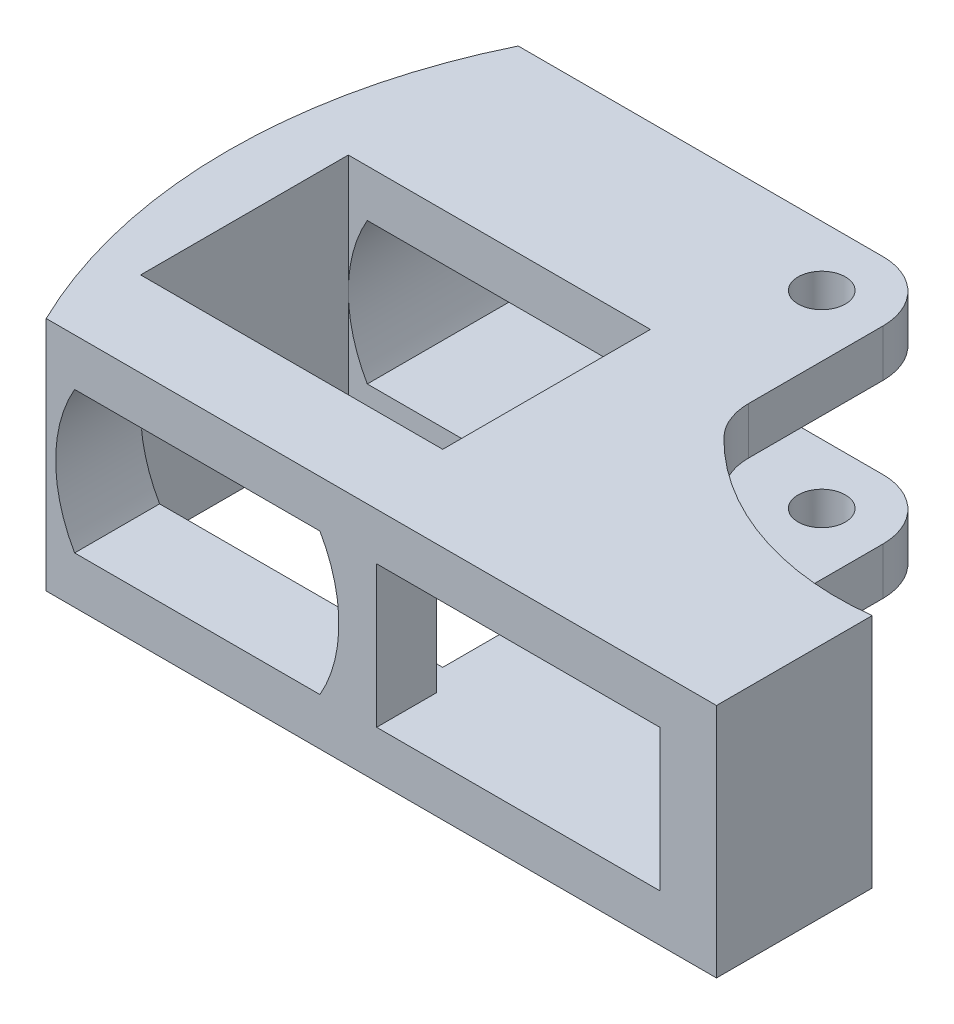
ISO-10303-21;
HEADER;
FILE_DESCRIPTION(('STEP AP214'),'2;1');
FILE_NAME('part.step','',(''),(''),'','','');
FILE_SCHEMA(('AUTOMOTIVE_DESIGN { 1 0 10303 214 1 1 1 1 }'));
ENDSEC;
DATA;
#1=APPLICATION_CONTEXT('core data for automotive mechanical design processes');
#2=APPLICATION_PROTOCOL_DEFINITION('international standard','automotive_design',2000,#1);
#3=PRODUCT_CONTEXT('',#1,'mechanical');
#4=PRODUCT('Part','Part','',(#3));
#5=PRODUCT_RELATED_PRODUCT_CATEGORY('part','',(#4));
#6=PRODUCT_DEFINITION_FORMATION('','',#4);
#7=PRODUCT_DEFINITION_CONTEXT('part definition',#1,'design');
#8=PRODUCT_DEFINITION('design','',#6,#7);
#9=PRODUCT_DEFINITION_SHAPE('','',#8);
#10=(LENGTH_UNIT() NAMED_UNIT(*) SI_UNIT(.MILLI.,.METRE.));
#11=(NAMED_UNIT(*) PLANE_ANGLE_UNIT() SI_UNIT($,.RADIAN.));
#12=(NAMED_UNIT(*) SI_UNIT($,.STERADIAN.) SOLID_ANGLE_UNIT());
#13=UNCERTAINTY_MEASURE_WITH_UNIT(LENGTH_MEASURE(1.E-05),#10,'distance_accuracy_value','');
#14=(GEOMETRIC_REPRESENTATION_CONTEXT(3) GLOBAL_UNCERTAINTY_ASSIGNED_CONTEXT((#13)) GLOBAL_UNIT_ASSIGNED_CONTEXT((#10,
#11,#12)) REPRESENTATION_CONTEXT('',''));
#15=CARTESIAN_POINT('',(0.,0.,0.));
#16=DIRECTION('',(0.,0.,1.));
#17=DIRECTION('',(1.,0.,0.));
#18=AXIS2_PLACEMENT_3D('',#15,#16,#17);
#19=CARTESIAN_POINT('',(-34.5,-12.5,-31.));
#20=DIRECTION('',(0.,0.,-1.));
#21=DIRECTION('',(-1.,0.,0.));
#22=AXIS2_PLACEMENT_3D('',#19,#20,#21);
#23=PLANE('',#22);
#24=DIRECTION('',(1.,0.,0.));
#25=VECTOR('',#24,1.);
#26=CARTESIAN_POINT('',(-34.5,7.5,-31.));
#27=LINE('',#26,#25);
#28=CARTESIAN_POINT('',(-32.4903810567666,7.5,-31.));
#29=VERTEX_POINT('',#28);
#30=CARTESIAN_POINT('',(-2.5,7.5,-31.));
#31=VERTEX_POINT('',#30);
#32=EDGE_CURVE('E257',#29,#31,#27,.T.);
#33=ORIENTED_EDGE('',*,*,#32,.T.);
#34=DIRECTION('',(0.,1.,0.));
#35=VECTOR('',#34,1.);
#36=CARTESIAN_POINT('',(-2.5,-12.5,-31.));
#37=LINE('',#36,#35);
#38=CARTESIAN_POINT('',(-2.5,12.5,-31.));
#39=VERTEX_POINT('',#38);
#40=EDGE_CURVE('E311',#31,#39,#37,.T.);
#41=ORIENTED_EDGE('',*,*,#40,.T.);
#42=DIRECTION('',(-1.,0.,0.));
#43=VECTOR('',#42,1.);
#44=CARTESIAN_POINT('',(-34.5,12.5,-31.));
#45=LINE('',#44,#43);
#46=CARTESIAN_POINT('',(-34.5,12.5,-31.));
#47=VERTEX_POINT('',#46);
#48=EDGE_CURVE('E283',#39,#47,#45,.T.);
#49=ORIENTED_EDGE('',*,*,#48,.T.);
#50=DIRECTION('',(0.,1.,0.));
#51=VECTOR('',#50,1.);
#52=CARTESIAN_POINT('',(-34.5,-12.5,-31.));
#53=LINE('',#52,#51);
#54=CARTESIAN_POINT('',(-34.5,0.,-31.));
#55=VERTEX_POINT('',#54);
#56=EDGE_CURVE('E307',#55,#47,#53,.T.);
#57=ORIENTED_EDGE('',*,*,#56,.F.);
#58=CARTESIAN_POINT('',(-19.5,0.,-31.));
#59=DIRECTION('',(0.,0.,-1.));
#60=DIRECTION('',(-1.,0.,0.));
#61=AXIS2_PLACEMENT_3D('',#58,#59,#60);
#62=CIRCLE('',#61,15.);
#63=EDGE_CURVE('E275',#55,#29,#62,.T.);
#64=ORIENTED_EDGE('',*,*,#63,.T.);
#65=EDGE_LOOP('',(#33,#41,#49,#57,#64));
#66=FACE_BOUND('',#65,.T.);
#67=ADVANCED_FACE('F46',(#66),#23,.F.);
#68=CARTESIAN_POINT('',(-2.5,-12.5,-31.));
#69=DIRECTION('',(1.,0.,0.));
#70=DIRECTION('',(0.,0.,-1.));
#71=AXIS2_PLACEMENT_3D('',#68,#69,#70);
#72=PLANE('',#71);
#73=ORIENTED_EDGE('',*,*,#40,.F.);
#74=DIRECTION('',(0.,0.,1.));
#75=VECTOR('',#74,1.);
#76=CARTESIAN_POINT('',(-2.5,7.5,-31.));
#77=LINE('',#76,#75);
#78=CARTESIAN_POINT('',(-2.5,7.5,-9.00000000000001));
#79=VERTEX_POINT('',#78);
#80=EDGE_CURVE('E484',#31,#79,#77,.T.);
#81=ORIENTED_EDGE('',*,*,#80,.T.);
#82=DIRECTION('',(0.,1.,0.));
#83=VECTOR('',#82,1.);
#84=CARTESIAN_POINT('',(-2.5,-12.5,-9.00000000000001));
#85=LINE('',#84,#83);
#86=CARTESIAN_POINT('',(-2.5,12.5,-9.00000000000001));
#87=VERTEX_POINT('',#86);
#88=EDGE_CURVE('E315',#79,#87,#85,.T.);
#89=ORIENTED_EDGE('',*,*,#88,.T.);
#90=DIRECTION('',(0.,0.,-1.));
#91=VECTOR('',#90,1.);
#92=CARTESIAN_POINT('',(-2.5,12.5,-31.));
#93=LINE('',#92,#91);
#94=EDGE_CURVE('E298',#87,#39,#93,.T.);
#95=ORIENTED_EDGE('',*,*,#94,.T.);
#96=EDGE_LOOP('',(#73,#81,#89,#95));
#97=FACE_BOUND('',#96,.T.);
#98=ADVANCED_FACE('F544',(#97),#72,.F.);
#99=CARTESIAN_POINT('',(-34.5,-12.5,-9.00000000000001));
#100=DIRECTION('',(0.,0.,1.));
#101=DIRECTION('',(1.,0.,0.));
#102=AXIS2_PLACEMENT_3D('',#99,#100,#101);
#103=PLANE('',#102);
#104=ORIENTED_EDGE('',*,*,#88,.F.);
#105=DIRECTION('',(-1.,0.,0.));
#106=VECTOR('',#105,1.);
#107=CARTESIAN_POINT('',(-34.5,7.5,-9.00000000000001));
#108=LINE('',#107,#106);
#109=CARTESIAN_POINT('',(-32.4903810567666,7.5,-9.00000000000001));
#110=VERTEX_POINT('',#109);
#111=EDGE_CURVE('E385',#79,#110,#108,.T.);
#112=ORIENTED_EDGE('',*,*,#111,.T.);
#113=CARTESIAN_POINT('',(-19.5,0.,-9.00000000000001));
#114=DIRECTION('',(0.,0.,1.));
#115=DIRECTION('',(1.,0.,0.));
#116=AXIS2_PLACEMENT_3D('',#113,#114,#115);
#117=CIRCLE('',#116,15.);
#118=CARTESIAN_POINT('',(-34.5,0.,-9.00000000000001));
#119=VERTEX_POINT('',#118);
#120=EDGE_CURVE('E387',#110,#119,#117,.T.);
#121=ORIENTED_EDGE('',*,*,#120,.T.);
#122=DIRECTION('',(0.,1.,0.));
#123=VECTOR('',#122,1.);
#124=CARTESIAN_POINT('',(-34.5,-12.5,-9.00000000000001));
#125=LINE('',#124,#123);
#126=CARTESIAN_POINT('',(-34.5,12.5,-9.00000000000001));
#127=VERTEX_POINT('',#126);
#128=EDGE_CURVE('E292',#119,#127,#125,.T.);
#129=ORIENTED_EDGE('',*,*,#128,.T.);
#130=DIRECTION('',(1.,0.,0.));
#131=VECTOR('',#130,1.);
#132=CARTESIAN_POINT('',(-34.5,12.5,-9.00000000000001));
#133=LINE('',#132,#131);
#134=EDGE_CURVE('E295',#127,#87,#133,.T.);
#135=ORIENTED_EDGE('',*,*,#134,.T.);
#136=EDGE_LOOP('',(#104,#112,#121,#129,#135));
#137=FACE_BOUND('',#136,.T.);
#138=ADVANCED_FACE('F542',(#137),#103,.F.);
#139=CARTESIAN_POINT('',(9.5,12.5,-50.));
#140=DIRECTION('',(1.,0.,0.));
#141=DIRECTION('',(0.,0.,-1.));
#142=AXIS2_PLACEMENT_3D('',#139,#140,#141);
#143=PLANE('',#142);
#144=DIRECTION('',(0.,0.,1.));
#145=VECTOR('',#144,1.);
#146=CARTESIAN_POINT('',(9.5,7.5,-50.));
#147=LINE('',#146,#145);
#148=CARTESIAN_POINT('',(9.5,7.5,-43.65));
#149=VERTEX_POINT('',#148);
#150=CARTESIAN_POINT('',(9.5,7.5,-29.414084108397));
#151=VERTEX_POINT('',#150);
#152=EDGE_CURVE('E407',#149,#151,#147,.T.);
#153=ORIENTED_EDGE('',*,*,#152,.F.);
#154=DIRECTION('',(0.,-1.,0.));
#155=VECTOR('',#154,1.);
#156=CARTESIAN_POINT('',(9.5,12.5,-43.65));
#157=LINE('',#156,#155);
#158=CARTESIAN_POINT('',(9.5,12.5,-43.65));
#159=VERTEX_POINT('',#158);
#160=EDGE_CURVE('E371',#149,#159,#157,.F.);
#161=ORIENTED_EDGE('',*,*,#160,.T.);
#162=DIRECTION('',(0.,0.,1.));
#163=VECTOR('',#162,1.);
#164=CARTESIAN_POINT('',(9.5,12.5,-50.));
#165=LINE('',#164,#163);
#166=CARTESIAN_POINT('',(9.5,12.5,-29.414084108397));
#167=VERTEX_POINT('',#166);
#168=EDGE_CURVE('E330',#159,#167,#165,.T.);
#169=ORIENTED_EDGE('',*,*,#168,.T.);
#170=DIRECTION('',(0.,1.,0.));
#171=VECTOR('',#170,1.);
#172=CARTESIAN_POINT('',(9.5,-12.5,-29.414084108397));
#173=LINE('',#172,#171);
#174=EDGE_CURVE('E368',#167,#151,#173,.F.);
#175=ORIENTED_EDGE('',*,*,#174,.T.);
#176=EDGE_LOOP('',(#153,#161,#169,#175));
#177=FACE_BOUND('',#176,.T.);
#178=ADVANCED_FACE('F406',(#177),#143,.T.);
#179=CARTESIAN_POINT('',(3.15,12.5,-43.65));
#180=DIRECTION('',(0.,-1.,0.));
#181=DIRECTION('',(0.,0.,-1.));
#182=AXIS2_PLACEMENT_3D('',#179,#180,#181);
#183=CYLINDRICAL_SURFACE('',#182,6.35);
#184=CARTESIAN_POINT('',(3.15,7.5,-43.65));
#185=DIRECTION('',(0.,1.,0.));
#186=DIRECTION('',(0.,0.,1.));
#187=AXIS2_PLACEMENT_3D('',#184,#185,#186);
#188=CIRCLE('',#187,6.35);
#189=CARTESIAN_POINT('',(3.15,7.5,-50.));
#190=VERTEX_POINT('',#189);
#191=EDGE_CURVE('E419',#190,#149,#188,.F.);
#192=ORIENTED_EDGE('',*,*,#191,.F.);
#193=DIRECTION('',(0.,-1.,0.));
#194=VECTOR('',#193,1.);
#195=CARTESIAN_POINT('',(3.15,12.5,-50.));
#196=LINE('',#195,#194);
#197=CARTESIAN_POINT('',(3.14999999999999,12.5,-50.));
#198=VERTEX_POINT('',#197);
#199=EDGE_CURVE('E362',#198,#190,#196,.T.);
#200=ORIENTED_EDGE('',*,*,#199,.F.);
#201=CARTESIAN_POINT('',(3.15,12.5,-43.65));
#202=DIRECTION('',(0.,1.,0.));
#203=DIRECTION('',(0.,0.,1.));
#204=AXIS2_PLACEMENT_3D('',#201,#202,#203);
#205=CIRCLE('',#204,6.35);
#206=EDGE_CURVE('E375',#159,#198,#205,.T.);
#207=ORIENTED_EDGE('',*,*,#206,.F.);
#208=ORIENTED_EDGE('',*,*,#160,.F.);
#209=EDGE_LOOP('',(#192,#200,#207,#208));
#210=FACE_BOUND('',#209,.T.);
#211=ADVANCED_FACE('F418',(#210),#183,.T.);
#212=CARTESIAN_POINT('',(15.85,12.5,-29.414084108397));
#213=DIRECTION('',(0.,-1.,0.));
#214=DIRECTION('',(0.,0.,-1.));
#215=AXIS2_PLACEMENT_3D('',#212,#213,#214);
#216=CYLINDRICAL_SURFACE('',#215,6.35);
#217=DIRECTION('',(0.,-1.,0.));
#218=VECTOR('',#217,1.);
#219=CARTESIAN_POINT('',(11.3206041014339,12.5,-24.9635703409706));
#220=LINE('',#219,#218);
#221=CARTESIAN_POINT('',(11.3206041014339,7.5,-24.9635703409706));
#222=VERTEX_POINT('',#221);
#223=CARTESIAN_POINT('',(11.3206041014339,12.5,-24.9635703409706));
#224=VERTEX_POINT('',#223);
#225=EDGE_CURVE('E377',#222,#224,#220,.F.);
#226=ORIENTED_EDGE('',*,*,#225,.F.);
#227=CARTESIAN_POINT('',(15.85,7.5,-29.414084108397));
#228=DIRECTION('',(0.,1.,0.));
#229=DIRECTION('',(0.,0.,1.));
#230=AXIS2_PLACEMENT_3D('',#227,#228,#229);
#231=CIRCLE('',#230,6.35);
#232=EDGE_CURVE('E55',#222,#151,#231,.F.);
#233=ORIENTED_EDGE('',*,*,#232,.T.);
#234=ORIENTED_EDGE('',*,*,#174,.F.);
#235=CARTESIAN_POINT('',(15.85,12.5,-29.414084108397));
#236=DIRECTION('',(0.,1.,0.));
#237=DIRECTION('',(0.,0.,1.));
#238=AXIS2_PLACEMENT_3D('',#235,#236,#237);
#239=CIRCLE('',#238,6.35);
#240=EDGE_CURVE('E383',#224,#167,#239,.F.);
#241=ORIENTED_EDGE('',*,*,#240,.F.);
#242=EDGE_LOOP('',(#226,#233,#234,#241));
#243=FACE_BOUND('',#242,.T.);
#244=ADVANCED_FACE('F400',(#243),#216,.F.);
#245=CARTESIAN_POINT('',(15.7249938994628,12.5,-25.));
#246=DIRECTION('',(0.,-1.,0.));
#247=DIRECTION('',(0.,0.,-1.));
#248=AXIS2_PLACEMENT_3D('',#245,#246,#247);
#249=CYLINDRICAL_SURFACE('',#248,57.);
#250=CARTESIAN_POINT('',(15.7249938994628,-12.5,-25.));
#251=DIRECTION('',(0.,1.,0.));
#252=DIRECTION('',(0.,0.,1.));
#253=AXIS2_PLACEMENT_3D('',#250,#251,#252);
#254=CIRCLE('',#253,57.);
#255=CARTESIAN_POINT('',(-35.5,-12.5,-50.));
#256=VERTEX_POINT('',#255);
#257=CARTESIAN_POINT('',(-35.5,-12.5,0.));
#258=VERTEX_POINT('',#257);
#259=EDGE_CURVE('E306',#256,#258,#254,.T.);
#260=ORIENTED_EDGE('',*,*,#259,.T.);
#261=DIRECTION('',(0.,-1.,0.));
#262=VECTOR('',#261,1.);
#263=CARTESIAN_POINT('',(-35.5,12.5,0.));
#264=LINE('',#263,#262);
#265=CARTESIAN_POINT('',(-35.5,12.5,0.));
#266=VERTEX_POINT('',#265);
#267=EDGE_CURVE('E358',#266,#258,#264,.T.);
#268=ORIENTED_EDGE('',*,*,#267,.F.);
#269=CARTESIAN_POINT('',(15.7249938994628,12.5,-25.));
#270=DIRECTION('',(0.,1.,0.));
#271=DIRECTION('',(0.,0.,1.));
#272=AXIS2_PLACEMENT_3D('',#269,#270,#271);
#273=CIRCLE('',#272,57.);
#274=CARTESIAN_POINT('',(-35.5,12.5,-50.));
#275=VERTEX_POINT('',#274);
#276=EDGE_CURVE('E319',#275,#266,#273,.T.);
#277=ORIENTED_EDGE('',*,*,#276,.F.);
#278=DIRECTION('',(0.,-1.,0.));
#279=VECTOR('',#278,1.);
#280=CARTESIAN_POINT('',(-35.5,12.5,-50.));
#281=LINE('',#280,#279);
#282=EDGE_CURVE('E336',#275,#256,#281,.T.);
#283=ORIENTED_EDGE('',*,*,#282,.T.);
#284=EDGE_LOOP('',(#260,#268,#277,#283));
#285=FACE_BOUND('',#284,.T.);
#286=ADVANCED_FACE('F430',(#285),#249,.T.);
#287=CARTESIAN_POINT('',(-35.5,12.5,0.));
#288=DIRECTION('',(0.,0.,-1.));
#289=DIRECTION('',(-1.,0.,0.));
#290=AXIS2_PLACEMENT_3D('',#287,#288,#289);
#291=PLANE('',#290);
#292=DIRECTION('',(1.,0.,0.));
#293=VECTOR('',#292,1.);
#294=CARTESIAN_POINT('',(-0.5,-7.5,0.));
#295=LINE('',#294,#293);
#296=CARTESIAN_POINT('',(-0.5,-7.5,0.));
#297=VERTEX_POINT('',#296);
#298=CARTESIAN_POINT('',(29.5,-7.5,0.));
#299=VERTEX_POINT('',#298);
#300=EDGE_CURVE('E489',#297,#299,#295,.T.);
#301=ORIENTED_EDGE('',*,*,#300,.F.);
#302=DIRECTION('',(0.,-1.,0.));
#303=VECTOR('',#302,1.);
#304=CARTESIAN_POINT('',(-0.5,7.5,0.));
#305=LINE('',#304,#303);
#306=CARTESIAN_POINT('',(-0.5,7.5,0.));
#307=VERTEX_POINT('',#306);
#308=EDGE_CURVE('E487',#307,#297,#305,.T.);
#309=ORIENTED_EDGE('',*,*,#308,.F.);
#310=DIRECTION('',(-1.,0.,0.));
#311=VECTOR('',#310,1.);
#312=CARTESIAN_POINT('',(-0.5,7.5,0.));
#313=LINE('',#312,#311);
#314=CARTESIAN_POINT('',(29.5,7.5,0.));
#315=VERTEX_POINT('',#314);
#316=EDGE_CURVE('E494',#315,#307,#313,.T.);
#317=ORIENTED_EDGE('',*,*,#316,.F.);
#318=DIRECTION('',(0.,1.,0.));
#319=VECTOR('',#318,1.);
#320=CARTESIAN_POINT('',(29.5,7.5,0.));
#321=LINE('',#320,#319);
#322=EDGE_CURVE('E491',#299,#315,#321,.T.);
#323=ORIENTED_EDGE('',*,*,#322,.F.);
#324=EDGE_LOOP('',(#301,#309,#317,#323));
#325=FACE_BOUND('',#324,.T.);
#326=DIRECTION('',(-1.,0.,0.));
#327=VECTOR('',#326,1.);
#328=CARTESIAN_POINT('',(-32.4903810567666,7.5,0.));
#329=LINE('',#328,#327);
#330=CARTESIAN_POINT('',(-6.50961894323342,7.5,0.));
#331=VERTEX_POINT('',#330);
#332=CARTESIAN_POINT('',(-32.4903810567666,7.5,0.));
#333=VERTEX_POINT('',#332);
#334=EDGE_CURVE('E458',#331,#333,#329,.T.);
#335=ORIENTED_EDGE('',*,*,#334,.F.);
#336=CARTESIAN_POINT('',(-19.5,0.,0.));
#337=DIRECTION('',(0.,0.,1.));
#338=DIRECTION('',(1.,0.,0.));
#339=AXIS2_PLACEMENT_3D('',#336,#337,#338);
#340=CIRCLE('',#339,15.);
#341=CARTESIAN_POINT('',(-6.50961894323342,-7.5,0.));
#342=VERTEX_POINT('',#341);
#343=EDGE_CURVE('E447',#342,#331,#340,.T.);
#344=ORIENTED_EDGE('',*,*,#343,.F.);
#345=DIRECTION('',(1.,0.,0.));
#346=VECTOR('',#345,1.);
#347=CARTESIAN_POINT('',(-32.4903810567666,-7.5,0.));
#348=LINE('',#347,#346);
#349=CARTESIAN_POINT('',(-32.4903810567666,-7.5,0.));
#350=VERTEX_POINT('',#349);
#351=EDGE_CURVE('E255',#350,#342,#348,.T.);
#352=ORIENTED_EDGE('',*,*,#351,.F.);
#353=CARTESIAN_POINT('',(-19.5,0.,0.));
#354=DIRECTION('',(0.,0.,1.));
#355=DIRECTION('',(1.,0.,0.));
#356=AXIS2_PLACEMENT_3D('',#353,#354,#355);
#357=CIRCLE('',#356,15.);
#358=EDGE_CURVE('E460',#333,#350,#357,.T.);
#359=ORIENTED_EDGE('',*,*,#358,.F.);
#360=EDGE_LOOP('',(#335,#344,#352,#359));
#361=FACE_BOUND('',#360,.T.);
#362=DIRECTION('',(1.,0.,0.));
#363=VECTOR('',#362,1.);
#364=CARTESIAN_POINT('',(-35.5,-12.5,0.));
#365=LINE('',#364,#363);
#366=CARTESIAN_POINT('',(35.5,-12.5,0.));
#367=VERTEX_POINT('',#366);
#368=EDGE_CURVE('E339',#258,#367,#365,.T.);
#369=ORIENTED_EDGE('',*,*,#368,.T.);
#370=DIRECTION('',(0.,-1.,0.));
#371=VECTOR('',#370,1.);
#372=CARTESIAN_POINT('',(35.5,12.5,0.));
#373=LINE('',#372,#371);
#374=CARTESIAN_POINT('',(35.5,12.5,0.));
#375=VERTEX_POINT('',#374);
#376=EDGE_CURVE('E355',#375,#367,#373,.T.);
#377=ORIENTED_EDGE('',*,*,#376,.F.);
#378=DIRECTION('',(1.,0.,0.));
#379=VECTOR('',#378,1.);
#380=CARTESIAN_POINT('',(-35.5,12.5,0.));
#381=LINE('',#380,#379);
#382=EDGE_CURVE('E322',#266,#375,#381,.T.);
#383=ORIENTED_EDGE('',*,*,#382,.F.);
#384=ORIENTED_EDGE('',*,*,#267,.T.);
#385=EDGE_LOOP('',(#369,#377,#383,#384));
#386=FACE_BOUND('',#385,.T.);
#387=ADVANCED_FACE('F433',(#325,#361,#386),#291,.F.);
#388=CARTESIAN_POINT('',(35.5,12.5,0.));
#389=DIRECTION('',(-1.,0.,0.));
#390=DIRECTION('',(0.,0.,1.));
#391=AXIS2_PLACEMENT_3D('',#388,#389,#390);
#392=PLANE('',#391);
#393=DIRECTION('',(0.,0.,-1.));
#394=VECTOR('',#393,1.);
#395=CARTESIAN_POINT('',(35.5,-12.5,0.));
#396=LINE('',#395,#394);
#397=CARTESIAN_POINT('',(35.5,-12.5,-16.5));
#398=VERTEX_POINT('',#397);
#399=EDGE_CURVE('E341',#367,#398,#396,.T.);
#400=ORIENTED_EDGE('',*,*,#399,.T.);
#401=DIRECTION('',(0.,-1.,0.));
#402=VECTOR('',#401,1.);
#403=CARTESIAN_POINT('',(35.5,12.5,-16.5));
#404=LINE('',#403,#402);
#405=CARTESIAN_POINT('',(35.5,12.5,-16.5));
#406=VERTEX_POINT('',#405);
#407=EDGE_CURVE('E352',#406,#398,#404,.T.);
#408=ORIENTED_EDGE('',*,*,#407,.F.);
#409=DIRECTION('',(0.,0.,-1.));
#410=VECTOR('',#409,1.);
#411=CARTESIAN_POINT('',(35.5,12.5,0.));
#412=LINE('',#411,#410);
#413=EDGE_CURVE('E325',#375,#406,#412,.T.);
#414=ORIENTED_EDGE('',*,*,#413,.F.);
#415=ORIENTED_EDGE('',*,*,#376,.T.);
#416=EDGE_LOOP('',(#400,#408,#414,#415));
#417=FACE_BOUND('',#416,.T.);
#418=ADVANCED_FACE('F438',(#417),#392,.F.);
#419=CARTESIAN_POINT('',(32.0060341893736,12.5,-45.2887513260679));
#420=DIRECTION('',(0.,-1.,0.));
#421=DIRECTION('',(0.,0.,-1.));
#422=AXIS2_PLACEMENT_3D('',#419,#420,#421);
#423=CYLINDRICAL_SURFACE('',#422,29.);
#424=CARTESIAN_POINT('',(32.0060341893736,7.5,-45.2887513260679));
#425=DIRECTION('',(0.,1.,0.));
#426=DIRECTION('',(0.,0.,1.));
#427=AXIS2_PLACEMENT_3D('',#424,#425,#426);
#428=CIRCLE('',#427,29.);
#429=CARTESIAN_POINT('',(29.5,7.5,-16.3972336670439));
#430=VERTEX_POINT('',#429);
#431=EDGE_CURVE('E443',#222,#430,#428,.T.);
#432=ORIENTED_EDGE('',*,*,#431,.F.);
#433=ORIENTED_EDGE('',*,*,#225,.T.);
#434=CARTESIAN_POINT('',(32.0060341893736,12.5,-45.2887513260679));
#435=DIRECTION('',(0.,1.,0.));
#436=DIRECTION('',(0.,0.,1.));
#437=AXIS2_PLACEMENT_3D('',#434,#435,#436);
#438=CIRCLE('',#437,29.);
#439=EDGE_CURVE('E328',#224,#406,#438,.T.);
#440=ORIENTED_EDGE('',*,*,#439,.T.);
#441=ORIENTED_EDGE('',*,*,#407,.T.);
#442=CARTESIAN_POINT('',(32.0060341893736,-12.5,-45.2887513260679));
#443=DIRECTION('',(0.,1.,0.));
#444=DIRECTION('',(0.,0.,1.));
#445=AXIS2_PLACEMENT_3D('',#442,#443,#444);
#446=CIRCLE('',#445,29.);
#447=CARTESIAN_POINT('',(11.3206041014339,-12.5,-24.9635703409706));
#448=VERTEX_POINT('',#447);
#449=EDGE_CURVE('E344',#448,#398,#446,.T.);
#450=ORIENTED_EDGE('',*,*,#449,.F.);
#451=CARTESIAN_POINT('',(11.3206041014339,-7.5,-24.9635703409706));
#452=VERTEX_POINT('',#451);
#453=EDGE_CURVE('E378',#448,#452,#220,.F.);
#454=ORIENTED_EDGE('',*,*,#453,.T.);
#455=CARTESIAN_POINT('',(32.0060341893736,-7.5,-45.2887513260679));
#456=DIRECTION('',(0.,-1.,0.));
#457=DIRECTION('',(0.,0.,-1.));
#458=AXIS2_PLACEMENT_3D('',#455,#456,#457);
#459=CIRCLE('',#458,29.);
#460=CARTESIAN_POINT('',(29.5,-7.5,-16.3972336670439));
#461=VERTEX_POINT('',#460);
#462=EDGE_CURVE('E504',#461,#452,#459,.T.);
#463=ORIENTED_EDGE('',*,*,#462,.F.);
#464=DIRECTION('',(0.,-1.,0.));
#465=VECTOR('',#464,1.);
#466=CARTESIAN_POINT('',(29.5,12.5,-16.3972336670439));
#467=LINE('',#466,#465);
#468=EDGE_CURVE('E13',#430,#461,#467,.T.);
#469=ORIENTED_EDGE('',*,*,#468,.F.);
#470=EDGE_LOOP('',(#432,#433,#440,#441,#450,#454,#463,#469));
#471=FACE_BOUND('',#470,.T.);
#472=ADVANCED_FACE('F440',(#471),#423,.F.);
#473=DIRECTION('',(0.,0.,-1.));
#474=VECTOR('',#473,1.);
#475=CARTESIAN_POINT('',(9.5,-7.5,-50.));
#476=LINE('',#475,#474);
#477=CARTESIAN_POINT('',(9.5,-7.5,-29.414084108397));
#478=VERTEX_POINT('',#477);
#479=CARTESIAN_POINT('',(9.5,-7.5,-43.65));
#480=VERTEX_POINT('',#479);
#481=EDGE_CURVE('E497',#478,#480,#476,.T.);
#482=ORIENTED_EDGE('',*,*,#481,.F.);
#483=CARTESIAN_POINT('',(9.5,-12.5,-29.414084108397));
#484=VERTEX_POINT('',#483);
#485=EDGE_CURVE('E367',#478,#484,#173,.F.);
#486=ORIENTED_EDGE('',*,*,#485,.T.);
#487=DIRECTION('',(0.,0.,1.));
#488=VECTOR('',#487,1.);
#489=CARTESIAN_POINT('',(9.5,-12.5,-50.));
#490=LINE('',#489,#488);
#491=CARTESIAN_POINT('',(9.5,-12.5,-43.65));
#492=VERTEX_POINT('',#491);
#493=EDGE_CURVE('E346',#492,#484,#490,.T.);
#494=ORIENTED_EDGE('',*,*,#493,.F.);
#495=EDGE_CURVE('E372',#492,#480,#157,.F.);
#496=ORIENTED_EDGE('',*,*,#495,.T.);
#497=EDGE_LOOP('',(#482,#486,#494,#496));
#498=FACE_BOUND('',#497,.T.);
#499=ADVANCED_FACE('F559',(#498),#143,.T.);
#500=CARTESIAN_POINT('',(-35.5,12.5,-50.));
#501=DIRECTION('',(0.,0.,-1.));
#502=DIRECTION('',(-1.,0.,0.));
#503=AXIS2_PLACEMENT_3D('',#500,#501,#502);
#504=PLANE('',#503);
#505=ORIENTED_EDGE('',*,*,#199,.T.);
#506=DIRECTION('',(-1.,0.,0.));
#507=VECTOR('',#506,1.);
#508=CARTESIAN_POINT('',(-32.4903810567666,7.5,-50.));
#509=LINE('',#508,#507);
#510=CARTESIAN_POINT('',(-32.4903810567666,7.5,-50.));
#511=VERTEX_POINT('',#510);
#512=EDGE_CURVE('E423',#190,#511,#509,.T.);
#513=ORIENTED_EDGE('',*,*,#512,.T.);
#514=CARTESIAN_POINT('',(-19.5,0.,-50.));
#515=DIRECTION('',(0.,0.,1.));
#516=DIRECTION('',(1.,0.,0.));
#517=AXIS2_PLACEMENT_3D('',#514,#515,#516);
#518=CIRCLE('',#517,15.);
#519=CARTESIAN_POINT('',(-32.4903810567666,-7.5,-50.));
#520=VERTEX_POINT('',#519);
#521=EDGE_CURVE('E454',#511,#520,#518,.T.);
#522=ORIENTED_EDGE('',*,*,#521,.T.);
#523=DIRECTION('',(1.,0.,0.));
#524=VECTOR('',#523,1.);
#525=CARTESIAN_POINT('',(-32.4903810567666,-7.5,-50.));
#526=LINE('',#525,#524);
#527=CARTESIAN_POINT('',(3.15,-7.5,-50.));
#528=VERTEX_POINT('',#527);
#529=EDGE_CURVE('E271',#520,#528,#526,.T.);
#530=ORIENTED_EDGE('',*,*,#529,.T.);
#531=CARTESIAN_POINT('',(3.14999999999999,-12.5,-50.));
#532=VERTEX_POINT('',#531);
#533=EDGE_CURVE('E361',#528,#532,#196,.T.);
#534=ORIENTED_EDGE('',*,*,#533,.T.);
#535=DIRECTION('',(1.,0.,0.));
#536=VECTOR('',#535,1.);
#537=CARTESIAN_POINT('',(-35.5,-12.5,-50.));
#538=LINE('',#537,#536);
#539=EDGE_CURVE('E323',#256,#532,#538,.T.);
#540=ORIENTED_EDGE('',*,*,#539,.F.);
#541=ORIENTED_EDGE('',*,*,#282,.F.);
#542=DIRECTION('',(1.,0.,0.));
#543=VECTOR('',#542,1.);
#544=CARTESIAN_POINT('',(-35.5,12.5,-50.));
#545=LINE('',#544,#543);
#546=EDGE_CURVE('E333',#275,#198,#545,.T.);
#547=ORIENTED_EDGE('',*,*,#546,.T.);
#548=EDGE_LOOP('',(#505,#513,#522,#530,#534,#540,#541,#547));
#549=FACE_BOUND('',#548,.T.);
#550=ADVANCED_FACE('F421',(#549),#504,.T.);
#551=CARTESIAN_POINT('',(15.7249938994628,12.5,-25.));
#552=DIRECTION('',(0.,1.,0.));
#553=DIRECTION('',(0.,0.,1.));
#554=AXIS2_PLACEMENT_3D('',#551,#552,#553);
#555=PLANE('',#554);
#556=CARTESIAN_POINT('',(3.,12.5,-43.65));
#557=DIRECTION('',(0.,1.,0.));
#558=DIRECTION('',(0.,0.,1.));
#559=AXIS2_PLACEMENT_3D('',#556,#557,#558);
#560=CIRCLE('',#559,2.5);
#561=CARTESIAN_POINT('',(3.,12.5,-41.15));
#562=VERTEX_POINT('',#561);
#563=EDGE_CURVE('E829',#562,#562,#560,.T.);
#564=ORIENTED_EDGE('',*,*,#563,.F.);
#565=EDGE_LOOP('',(#564));
#566=FACE_BOUND('',#565,.T.);
#567=DIRECTION('',(0.,0.,1.));
#568=VECTOR('',#567,1.);
#569=CARTESIAN_POINT('',(-34.5,12.5,-31.));
#570=LINE('',#569,#568);
#571=EDGE_CURVE('E278',#47,#127,#570,.T.);
#572=ORIENTED_EDGE('',*,*,#571,.F.);
#573=ORIENTED_EDGE('',*,*,#48,.F.);
#574=ORIENTED_EDGE('',*,*,#94,.F.);
#575=ORIENTED_EDGE('',*,*,#134,.F.);
#576=EDGE_LOOP('',(#572,#573,#574,#575));
#577=FACE_BOUND('',#576,.T.);
#578=ORIENTED_EDGE('',*,*,#168,.F.);
#579=ORIENTED_EDGE('',*,*,#206,.T.);
#580=ORIENTED_EDGE('',*,*,#546,.F.);
#581=ORIENTED_EDGE('',*,*,#276,.T.);
#582=ORIENTED_EDGE('',*,*,#382,.T.);
#583=ORIENTED_EDGE('',*,*,#413,.T.);
#584=ORIENTED_EDGE('',*,*,#439,.F.);
#585=ORIENTED_EDGE('',*,*,#240,.T.);
#586=EDGE_LOOP('',(#578,#579,#580,#581,#582,#583,#584,#585));
#587=FACE_BOUND('',#586,.T.);
#588=ADVANCED_FACE('F412',(#566,#577,#587),#555,.T.);
#589=CARTESIAN_POINT('',(15.7249938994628,-12.5,-25.));
#590=DIRECTION('',(0.,1.,0.));
#591=DIRECTION('',(0.,0.,1.));
#592=AXIS2_PLACEMENT_3D('',#589,#590,#591);
#593=PLANE('',#592);
#594=CARTESIAN_POINT('',(3.,-12.5,-43.65));
#595=DIRECTION('',(0.,1.,0.));
#596=DIRECTION('',(0.,0.,1.));
#597=AXIS2_PLACEMENT_3D('',#594,#595,#596);
#598=CIRCLE('',#597,2.5);
#599=CARTESIAN_POINT('',(3.,-12.5,-41.15));
#600=VERTEX_POINT('',#599);
#601=EDGE_CURVE('E827',#600,#600,#598,.T.);
#602=ORIENTED_EDGE('',*,*,#601,.T.);
#603=EDGE_LOOP('',(#602));
#604=FACE_BOUND('',#603,.T.);
#605=DIRECTION('',(-1.,0.,0.));
#606=VECTOR('',#605,1.);
#607=CARTESIAN_POINT('',(-34.5,-12.5,-31.));
#608=LINE('',#607,#606);
#609=CARTESIAN_POINT('',(-2.5,-12.5,-31.));
#610=VERTEX_POINT('',#609);
#611=CARTESIAN_POINT('',(-34.5,-12.5,-31.));
#612=VERTEX_POINT('',#611);
#613=EDGE_CURVE('E289',#610,#612,#608,.T.);
#614=ORIENTED_EDGE('',*,*,#613,.T.);
#615=DIRECTION('',(0.,0.,1.));
#616=VECTOR('',#615,1.);
#617=CARTESIAN_POINT('',(-34.5,-12.5,-31.));
#618=LINE('',#617,#616);
#619=CARTESIAN_POINT('',(-34.5,-12.5,-9.00000000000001));
#620=VERTEX_POINT('',#619);
#621=EDGE_CURVE('E279',#612,#620,#618,.T.);
#622=ORIENTED_EDGE('',*,*,#621,.T.);
#623=DIRECTION('',(1.,0.,0.));
#624=VECTOR('',#623,1.);
#625=CARTESIAN_POINT('',(-34.5,-12.5,-9.00000000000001));
#626=LINE('',#625,#624);
#627=CARTESIAN_POINT('',(-2.5,-12.5,-9.00000000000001));
#628=VERTEX_POINT('',#627);
#629=EDGE_CURVE('E282',#620,#628,#626,.T.);
#630=ORIENTED_EDGE('',*,*,#629,.T.);
#631=DIRECTION('',(0.,0.,-1.));
#632=VECTOR('',#631,1.);
#633=CARTESIAN_POINT('',(-2.5,-12.5,-31.));
#634=LINE('',#633,#632);
#635=EDGE_CURVE('E286',#628,#610,#634,.T.);
#636=ORIENTED_EDGE('',*,*,#635,.T.);
#637=EDGE_LOOP('',(#614,#622,#630,#636));
#638=FACE_BOUND('',#637,.T.);
#639=ORIENTED_EDGE('',*,*,#539,.T.);
#640=CARTESIAN_POINT('',(3.15,-12.5,-43.65));
#641=DIRECTION('',(0.,1.,0.));
#642=DIRECTION('',(0.,0.,1.));
#643=AXIS2_PLACEMENT_3D('',#640,#641,#642);
#644=CIRCLE('',#643,6.35);
#645=EDGE_CURVE('E365',#532,#492,#644,.F.);
#646=ORIENTED_EDGE('',*,*,#645,.T.);
#647=ORIENTED_EDGE('',*,*,#493,.T.);
#648=CARTESIAN_POINT('',(15.85,-12.5,-29.414084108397));
#649=DIRECTION('',(0.,1.,0.));
#650=DIRECTION('',(0.,0.,1.));
#651=AXIS2_PLACEMENT_3D('',#648,#649,#650);
#652=CIRCLE('',#651,6.35);
#653=EDGE_CURVE('E381',#484,#448,#652,.T.);
#654=ORIENTED_EDGE('',*,*,#653,.T.);
#655=ORIENTED_EDGE('',*,*,#449,.T.);
#656=ORIENTED_EDGE('',*,*,#399,.F.);
#657=ORIENTED_EDGE('',*,*,#368,.F.);
#658=ORIENTED_EDGE('',*,*,#259,.F.);
#659=EDGE_LOOP('',(#639,#646,#647,#654,#655,#656,#657,#658));
#660=FACE_BOUND('',#659,.T.);
#661=ADVANCED_FACE('F535',(#604,#638,#660),#593,.F.);
#662=CARTESIAN_POINT('',(3.15,-7.5,-43.65));
#663=DIRECTION('',(0.,-1.,0.));
#664=DIRECTION('',(0.,0.,-1.));
#665=AXIS2_PLACEMENT_3D('',#662,#663,#664);
#666=CIRCLE('',#665,6.35);
#667=EDGE_CURVE('E449',#480,#528,#666,.F.);
#668=ORIENTED_EDGE('',*,*,#667,.F.);
#669=ORIENTED_EDGE('',*,*,#495,.F.);
#670=ORIENTED_EDGE('',*,*,#645,.F.);
#671=ORIENTED_EDGE('',*,*,#533,.F.);
#672=EDGE_LOOP('',(#668,#669,#670,#671));
#673=FACE_BOUND('',#672,.T.);
#674=ADVANCED_FACE('F513',(#673),#183,.T.);
#675=ORIENTED_EDGE('',*,*,#485,.F.);
#676=CARTESIAN_POINT('',(15.85,-7.5,-29.414084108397));
#677=DIRECTION('',(0.,-1.,0.));
#678=DIRECTION('',(0.,0.,-1.));
#679=AXIS2_PLACEMENT_3D('',#676,#677,#678);
#680=CIRCLE('',#679,6.35);
#681=EDGE_CURVE('E393',#478,#452,#680,.F.);
#682=ORIENTED_EDGE('',*,*,#681,.T.);
#683=ORIENTED_EDGE('',*,*,#453,.F.);
#684=ORIENTED_EDGE('',*,*,#653,.F.);
#685=EDGE_LOOP('',(#675,#682,#683,#684));
#686=FACE_BOUND('',#685,.T.);
#687=ADVANCED_FACE('F48',(#686),#216,.F.);
#688=CARTESIAN_POINT('',(-34.5,-12.5,-31.));
#689=DIRECTION('',(-1.,0.,0.));
#690=DIRECTION('',(0.,0.,1.));
#691=AXIS2_PLACEMENT_3D('',#688,#689,#690);
#692=PLANE('',#691);
#693=EDGE_CURVE('E303',#612,#55,#53,.T.);
#694=ORIENTED_EDGE('',*,*,#693,.T.);
#695=ORIENTED_EDGE('',*,*,#56,.T.);
#696=ORIENTED_EDGE('',*,*,#571,.T.);
#697=ORIENTED_EDGE('',*,*,#128,.F.);
#698=EDGE_CURVE('E316',#620,#119,#125,.T.);
#699=ORIENTED_EDGE('',*,*,#698,.F.);
#700=ORIENTED_EDGE('',*,*,#621,.F.);
#701=EDGE_LOOP('',(#694,#695,#696,#697,#699,#700));
#702=FACE_BOUND('',#701,.T.);
#703=ADVANCED_FACE('F538',(#702),#692,.F.);
#704=CARTESIAN_POINT('',(-2.5,-7.5,-31.));
#705=VERTEX_POINT('',#704);
#706=EDGE_CURVE('E308',#610,#705,#37,.T.);
#707=ORIENTED_EDGE('',*,*,#706,.T.);
#708=DIRECTION('',(-1.,0.,0.));
#709=VECTOR('',#708,1.);
#710=CARTESIAN_POINT('',(-34.5,-7.5,-31.));
#711=LINE('',#710,#709);
#712=CARTESIAN_POINT('',(-32.4903810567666,-7.5,-31.));
#713=VERTEX_POINT('',#712);
#714=EDGE_CURVE('E276',#705,#713,#711,.T.);
#715=ORIENTED_EDGE('',*,*,#714,.T.);
#716=EDGE_CURVE('E260',#713,#55,#62,.T.);
#717=ORIENTED_EDGE('',*,*,#716,.T.);
#718=ORIENTED_EDGE('',*,*,#693,.F.);
#719=ORIENTED_EDGE('',*,*,#613,.F.);
#720=EDGE_LOOP('',(#707,#715,#717,#718,#719));
#721=FACE_BOUND('',#720,.T.);
#722=ADVANCED_FACE('F524',(#721),#23,.F.);
#723=CARTESIAN_POINT('',(-2.5,-7.5,-9.00000000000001));
#724=VERTEX_POINT('',#723);
#725=EDGE_CURVE('E312',#628,#724,#85,.T.);
#726=ORIENTED_EDGE('',*,*,#725,.T.);
#727=DIRECTION('',(0.,0.,-1.));
#728=VECTOR('',#727,1.);
#729=CARTESIAN_POINT('',(-2.5,-7.5,-31.));
#730=LINE('',#729,#728);
#731=EDGE_CURVE('E250',#724,#705,#730,.T.);
#732=ORIENTED_EDGE('',*,*,#731,.T.);
#733=ORIENTED_EDGE('',*,*,#706,.F.);
#734=ORIENTED_EDGE('',*,*,#635,.F.);
#735=EDGE_LOOP('',(#726,#732,#733,#734));
#736=FACE_BOUND('',#735,.T.);
#737=ADVANCED_FACE('F529',(#736),#72,.F.);
#738=DIRECTION('',(1.,0.,0.));
#739=VECTOR('',#738,1.);
#740=CARTESIAN_POINT('',(-34.5,-7.5,-9.00000000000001));
#741=LINE('',#740,#739);
#742=CARTESIAN_POINT('',(-32.4903810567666,-7.5,-9.00000000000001));
#743=VERTEX_POINT('',#742);
#744=EDGE_CURVE('E391',#743,#724,#741,.T.);
#745=ORIENTED_EDGE('',*,*,#744,.T.);
#746=ORIENTED_EDGE('',*,*,#725,.F.);
#747=ORIENTED_EDGE('',*,*,#629,.F.);
#748=ORIENTED_EDGE('',*,*,#698,.T.);
#749=EDGE_CURVE('E390',#119,#743,#117,.T.);
#750=ORIENTED_EDGE('',*,*,#749,.T.);
#751=EDGE_LOOP('',(#745,#746,#747,#748,#750));
#752=FACE_BOUND('',#751,.T.);
#753=ADVANCED_FACE('F533',(#752),#103,.F.);
#754=CARTESIAN_POINT('',(-19.5,0.,-50.));
#755=DIRECTION('',(0.,0.,1.));
#756=DIRECTION('',(1.,0.,0.));
#757=AXIS2_PLACEMENT_3D('',#754,#755,#756);
#758=CYLINDRICAL_SURFACE('',#757,15.);
#759=DIRECTION('',(0.,0.,1.));
#760=VECTOR('',#759,1.);
#761=CARTESIAN_POINT('',(-32.4903810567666,7.5,-50.));
#762=LINE('',#761,#760);
#763=EDGE_CURVE('E270',#110,#333,#762,.T.);
#764=ORIENTED_EDGE('',*,*,#763,.T.);
#765=ORIENTED_EDGE('',*,*,#358,.T.);
#766=DIRECTION('',(0.,0.,1.));
#767=VECTOR('',#766,1.);
#768=CARTESIAN_POINT('',(-32.4903810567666,-7.5,-50.));
#769=LINE('',#768,#767);
#770=EDGE_CURVE('E262',#743,#350,#769,.T.);
#771=ORIENTED_EDGE('',*,*,#770,.F.);
#772=ORIENTED_EDGE('',*,*,#749,.F.);
#773=ORIENTED_EDGE('',*,*,#120,.F.);
#774=EDGE_LOOP('',(#764,#765,#771,#772,#773));
#775=FACE_BOUND('',#774,.T.);
#776=ADVANCED_FACE('F465',(#775),#758,.F.);
#777=CARTESIAN_POINT('',(-19.5,0.,-50.));
#778=DIRECTION('',(0.,0.,1.));
#779=DIRECTION('',(1.,0.,0.));
#780=AXIS2_PLACEMENT_3D('',#777,#778,#779);
#781=CYLINDRICAL_SURFACE('',#780,15.);
#782=DIRECTION('',(0.,0.,1.));
#783=VECTOR('',#782,1.);
#784=CARTESIAN_POINT('',(-6.50961894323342,7.5,-50.));
#785=LINE('',#784,#783);
#786=CARTESIAN_POINT('',(-6.50961894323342,7.5,-6.35));
#787=VERTEX_POINT('',#786);
#788=EDGE_CURVE('E249',#787,#331,#785,.T.);
#789=ORIENTED_EDGE('',*,*,#788,.F.);
#790=CARTESIAN_POINT('',(-19.5,0.,-6.35));
#791=DIRECTION('',(0.,0.,1.));
#792=DIRECTION('',(1.,0.,0.));
#793=AXIS2_PLACEMENT_3D('',#790,#791,#792);
#794=CIRCLE('',#793,15.);
#795=CARTESIAN_POINT('',(-6.50961894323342,-7.5,-6.35));
#796=VERTEX_POINT('',#795);
#797=EDGE_CURVE('E237',#787,#796,#794,.F.);
#798=ORIENTED_EDGE('',*,*,#797,.T.);
#799=DIRECTION('',(0.,0.,1.));
#800=VECTOR('',#799,1.);
#801=CARTESIAN_POINT('',(-6.50961894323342,-7.5,-50.));
#802=LINE('',#801,#800);
#803=EDGE_CURVE('E247',#796,#342,#802,.T.);
#804=ORIENTED_EDGE('',*,*,#803,.T.);
#805=ORIENTED_EDGE('',*,*,#343,.T.);
#806=EDGE_LOOP('',(#789,#798,#804,#805));
#807=FACE_BOUND('',#806,.T.);
#808=ADVANCED_FACE('F245',(#807),#781,.F.);
#809=CARTESIAN_POINT('',(-32.4903810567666,-7.5,-50.));
#810=DIRECTION('',(0.,-1.,0.));
#811=DIRECTION('',(0.,0.,-1.));
#812=AXIS2_PLACEMENT_3D('',#809,#810,#811);
#813=PLANE('',#812);
#814=CARTESIAN_POINT('',(3.,-7.5,-43.65));
#815=DIRECTION('',(0.,-1.,0.));
#816=DIRECTION('',(0.,0.,-1.));
#817=AXIS2_PLACEMENT_3D('',#814,#815,#816);
#818=CIRCLE('',#817,2.5);
#819=CARTESIAN_POINT('',(3.,-7.5,-46.15));
#820=VERTEX_POINT('',#819);
#821=EDGE_CURVE('E475',#820,#820,#818,.T.);
#822=ORIENTED_EDGE('',*,*,#821,.T.);
#823=EDGE_LOOP('',(#822));
#824=FACE_BOUND('',#823,.T.);
#825=EDGE_CURVE('E258',#520,#713,#769,.T.);
#826=ORIENTED_EDGE('',*,*,#825,.T.);
#827=ORIENTED_EDGE('',*,*,#714,.F.);
#828=ORIENTED_EDGE('',*,*,#731,.F.);
#829=ORIENTED_EDGE('',*,*,#744,.F.);
#830=ORIENTED_EDGE('',*,*,#770,.T.);
#831=ORIENTED_EDGE('',*,*,#351,.T.);
#832=ORIENTED_EDGE('',*,*,#803,.F.);
#833=DIRECTION('',(-1.,0.,0.));
#834=VECTOR('',#833,1.);
#835=CARTESIAN_POINT('',(9.,-7.5,-6.35));
#836=LINE('',#835,#834);
#837=CARTESIAN_POINT('',(-0.5,-7.5,-6.35));
#838=VERTEX_POINT('',#837);
#839=EDGE_CURVE('E62',#838,#796,#836,.T.);
#840=ORIENTED_EDGE('',*,*,#839,.F.);
#841=DIRECTION('',(0.,0.,1.));
#842=VECTOR('',#841,1.);
#843=CARTESIAN_POINT('',(-0.5,-7.5,-50.));
#844=LINE('',#843,#842);
#845=EDGE_CURVE('E67',#838,#297,#844,.T.);
#846=ORIENTED_EDGE('',*,*,#845,.T.);
#847=ORIENTED_EDGE('',*,*,#300,.T.);
#848=DIRECTION('',(0.,0.,1.));
#849=VECTOR('',#848,1.);
#850=CARTESIAN_POINT('',(29.5,-7.5,-50.));
#851=LINE('',#850,#849);
#852=EDGE_CURVE('E500',#461,#299,#851,.T.);
#853=ORIENTED_EDGE('',*,*,#852,.F.);
#854=ORIENTED_EDGE('',*,*,#462,.T.);
#855=ORIENTED_EDGE('',*,*,#681,.F.);
#856=ORIENTED_EDGE('',*,*,#481,.T.);
#857=ORIENTED_EDGE('',*,*,#667,.T.);
#858=ORIENTED_EDGE('',*,*,#529,.F.);
#859=EDGE_LOOP('',(#826,#827,#828,#829,#830,#831,#832,#840,#846,#847,#853,#854,#855,#856,#857,#858));
#860=FACE_BOUND('',#859,.T.);
#861=ADVANCED_FACE('F253',(#824,#860),#813,.F.);
#862=ORIENTED_EDGE('',*,*,#716,.F.);
#863=ORIENTED_EDGE('',*,*,#825,.F.);
#864=ORIENTED_EDGE('',*,*,#521,.F.);
#865=EDGE_CURVE('E267',#511,#29,#762,.T.);
#866=ORIENTED_EDGE('',*,*,#865,.T.);
#867=ORIENTED_EDGE('',*,*,#63,.F.);
#868=EDGE_LOOP('',(#862,#863,#864,#866,#867));
#869=FACE_BOUND('',#868,.T.);
#870=ADVANCED_FACE('F517',(#869),#758,.F.);
#871=CARTESIAN_POINT('',(-32.4903810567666,7.5,-50.));
#872=DIRECTION('',(0.,1.,0.));
#873=DIRECTION('',(0.,0.,1.));
#874=AXIS2_PLACEMENT_3D('',#871,#872,#873);
#875=PLANE('',#874);
#876=CARTESIAN_POINT('',(3.,7.5,-43.65));
#877=DIRECTION('',(0.,1.,0.));
#878=DIRECTION('',(0.,0.,1.));
#879=AXIS2_PLACEMENT_3D('',#876,#877,#878);
#880=CIRCLE('',#879,2.5);
#881=CARTESIAN_POINT('',(3.,7.5,-41.15));
#882=VERTEX_POINT('',#881);
#883=EDGE_CURVE('E50',#882,#882,#880,.T.);
#884=ORIENTED_EDGE('',*,*,#883,.T.);
#885=EDGE_LOOP('',(#884));
#886=FACE_BOUND('',#885,.T.);
#887=DIRECTION('',(1.,0.,0.));
#888=VECTOR('',#887,1.);
#889=CARTESIAN_POINT('',(9.,7.5,-6.35));
#890=LINE('',#889,#888);
#891=CARTESIAN_POINT('',(-0.5,7.5,-6.35));
#892=VERTEX_POINT('',#891);
#893=EDGE_CURVE('E241',#787,#892,#890,.T.);
#894=ORIENTED_EDGE('',*,*,#893,.F.);
#895=ORIENTED_EDGE('',*,*,#788,.T.);
#896=ORIENTED_EDGE('',*,*,#334,.T.);
#897=ORIENTED_EDGE('',*,*,#763,.F.);
#898=ORIENTED_EDGE('',*,*,#111,.F.);
#899=ORIENTED_EDGE('',*,*,#80,.F.);
#900=ORIENTED_EDGE('',*,*,#32,.F.);
#901=ORIENTED_EDGE('',*,*,#865,.F.);
#902=ORIENTED_EDGE('',*,*,#512,.F.);
#903=ORIENTED_EDGE('',*,*,#191,.T.);
#904=ORIENTED_EDGE('',*,*,#152,.T.);
#905=ORIENTED_EDGE('',*,*,#232,.F.);
#906=ORIENTED_EDGE('',*,*,#431,.T.);
#907=DIRECTION('',(0.,0.,1.));
#908=VECTOR('',#907,1.);
#909=CARTESIAN_POINT('',(29.5,7.5,-50.));
#910=LINE('',#909,#908);
#911=EDGE_CURVE('E498',#430,#315,#910,.T.);
#912=ORIENTED_EDGE('',*,*,#911,.T.);
#913=ORIENTED_EDGE('',*,*,#316,.T.);
#914=DIRECTION('',(0.,0.,1.));
#915=VECTOR('',#914,1.);
#916=CARTESIAN_POINT('',(-0.5,7.5,-50.));
#917=LINE('',#916,#915);
#918=EDGE_CURVE('E474',#892,#307,#917,.T.);
#919=ORIENTED_EDGE('',*,*,#918,.F.);
#920=EDGE_LOOP('',(#894,#895,#896,#897,#898,#899,#900,#901,#902,#903,#904,#905,#906,#912,#913,#919));
#921=FACE_BOUND('',#920,.T.);
#922=ADVANCED_FACE('F471',(#886,#921),#875,.F.);
#923=CARTESIAN_POINT('',(-0.5,7.5,-50.));
#924=DIRECTION('',(-1.,0.,0.));
#925=DIRECTION('',(0.,0.,1.));
#926=AXIS2_PLACEMENT_3D('',#923,#924,#925);
#927=PLANE('',#926);
#928=ORIENTED_EDGE('',*,*,#845,.F.);
#929=DIRECTION('',(0.,1.,0.));
#930=VECTOR('',#929,1.);
#931=CARTESIAN_POINT('',(-0.5,7.5,-6.35));
#932=LINE('',#931,#930);
#933=EDGE_CURVE('E240',#838,#892,#932,.T.);
#934=ORIENTED_EDGE('',*,*,#933,.T.);
#935=ORIENTED_EDGE('',*,*,#918,.T.);
#936=ORIENTED_EDGE('',*,*,#308,.T.);
#937=EDGE_LOOP('',(#928,#934,#935,#936));
#938=FACE_BOUND('',#937,.T.);
#939=ADVANCED_FACE('F612',(#938),#927,.F.);
#940=CARTESIAN_POINT('',(29.5,7.5,-50.));
#941=DIRECTION('',(1.,0.,0.));
#942=DIRECTION('',(0.,0.,-1.));
#943=AXIS2_PLACEMENT_3D('',#940,#941,#942);
#944=PLANE('',#943);
#945=ORIENTED_EDGE('',*,*,#468,.T.);
#946=ORIENTED_EDGE('',*,*,#852,.T.);
#947=ORIENTED_EDGE('',*,*,#322,.T.);
#948=ORIENTED_EDGE('',*,*,#911,.F.);
#949=EDGE_LOOP('',(#945,#946,#947,#948));
#950=FACE_BOUND('',#949,.T.);
#951=ADVANCED_FACE('F607',(#950),#944,.F.);
#952=CARTESIAN_POINT('',(0.,0.,-6.35));
#953=DIRECTION('',(0.,0.,1.));
#954=DIRECTION('',(1.,0.,0.));
#955=AXIS2_PLACEMENT_3D('',#952,#953,#954);
#956=PLANE('',#955);
#957=ORIENTED_EDGE('',*,*,#893,.T.);
#958=ORIENTED_EDGE('',*,*,#933,.F.);
#959=ORIENTED_EDGE('',*,*,#839,.T.);
#960=ORIENTED_EDGE('',*,*,#797,.F.);
#961=EDGE_LOOP('',(#957,#958,#959,#960));
#962=FACE_BOUND('',#961,.T.);
#963=ADVANCED_FACE('F236',(#962),#956,.F.);
#964=CARTESIAN_POINT('',(3.,-12.5,-43.65));
#965=DIRECTION('',(0.,1.,0.));
#966=DIRECTION('',(0.,0.,1.));
#967=AXIS2_PLACEMENT_3D('',#964,#965,#966);
#968=CYLINDRICAL_SURFACE('',#967,2.5);
#969=ORIENTED_EDGE('',*,*,#563,.T.);
#970=EDGE_LOOP('',(#969));
#971=FACE_BOUND('',#970,.T.);
#972=ORIENTED_EDGE('',*,*,#883,.F.);
#973=EDGE_LOOP('',(#972));
#974=FACE_BOUND('',#973,.T.);
#975=ADVANCED_FACE('F653',(#971,#974),#968,.F.);
#976=ORIENTED_EDGE('',*,*,#601,.F.);
#977=EDGE_LOOP('',(#976));
#978=FACE_BOUND('',#977,.T.);
#979=ORIENTED_EDGE('',*,*,#821,.F.);
#980=EDGE_LOOP('',(#979));
#981=FACE_BOUND('',#980,.T.);
#982=ADVANCED_FACE('F658',(#978,#981),#968,.F.);
#983=CLOSED_SHELL('',(#67,#98,#138,#178,#211,#244,#286,#387,#418,#472,#499,#550,#588,#661,#674,
#687,#703,#722,#737,#753,#776,#808,#861,#870,#922,#939,#951,#963,#975,#982));
#984=MANIFOLD_SOLID_BREP('B2',#983);
#985=ADVANCED_BREP_SHAPE_REPRESENTATION('',(#18,#984),#14);
#986=SHAPE_DEFINITION_REPRESENTATION(#9,#985);
ENDSEC;
END-ISO-10303-21;
